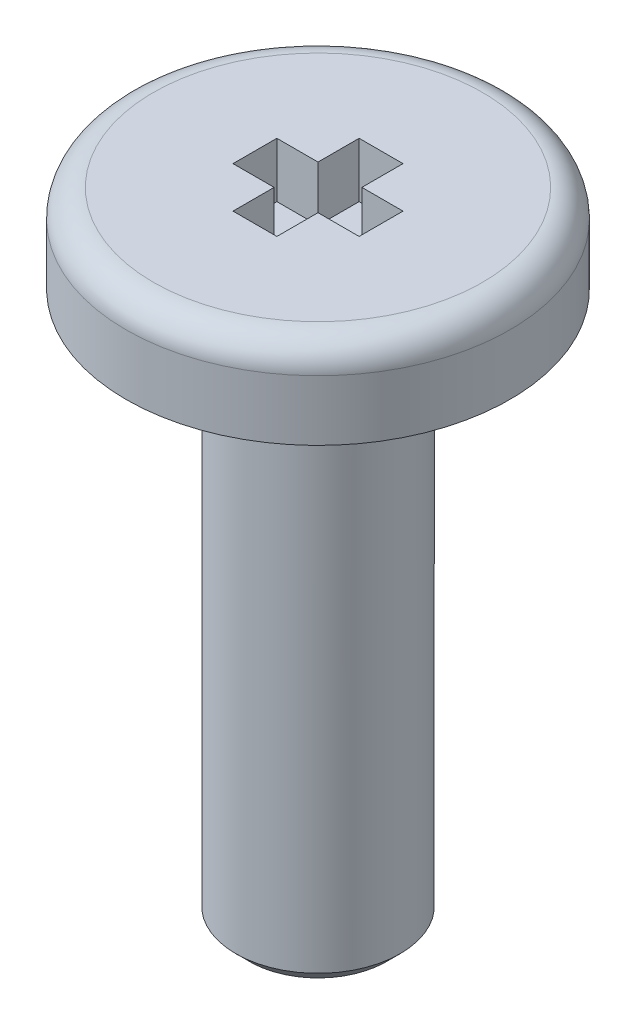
from build123d import *

# Parameters (mm, degrees)
SKETCH2_W               = 0.8
SKETCH2_H               = 2.3
CUT_EXTRUDE_THIN2_DEPTH = 1
CIRPATTERN1_COUNT       = 2
CIRPATTERN1_ANGLE       = 90
SKETCH3_R               = 1.5
BOSS_EXTRUDE1_DEPTH     = 10
FILLET1_R               = 0.2
CHAMFER1_SIZE           = 0.25


with BuildPart() as part:
    # Sketch1 → Base-Revolve (revolve)
    with BuildSketch(Plane.XY, mode=Mode.PRIVATE) as base_revolve_sk:
        with BuildLine():
            Line((3.5, 0), (0, 0))
            Line((0, 0), (0, 1.6))
            Line((0, 1.6), (3, 1.6))
            ThreePointArc((3, 1.6), (3.353553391, 1.453553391), (3.5, 1.1))
            Line((3.5, 1.1), (3.5, 0))
        make_face()
    revolve(base_revolve_sk.sketch.rotate(Axis((0, 11.592517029, 0), (0, -1, 0)), 90), axis=Axis((0, 11.592517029, 0), (0, -1, 0)))

    # Sketch2 → Cut-Extrude-Thin2 (cut)
    with BuildSketch(Plane(origin=(0, 1.6, 0), x_dir=(-1, 0, 0), z_dir=(0, 1, 0))):
        Rectangle(SKETCH2_W, SKETCH2_H)
    cut_extrude_thin2 = extrude(amount=-CUT_EXTRUDE_THIN2_DEPTH, mode=Mode.SUBTRACT)

    # CirPattern1: Cut-Extrude-Thin2 ×2 about axis
    cirpattern1_axis = Axis((0, 0, 0), (0, 1, 0))
    for i in range(1, CIRPATTERN1_COUNT):
        add(cut_extrude_thin2.rotate(cirpattern1_axis, i * CIRPATTERN1_ANGLE / (CIRPATTERN1_COUNT - 1)), mode=Mode.SUBTRACT)

    # Sketch3 → Boss-Extrude1 (add)
    with BuildSketch(Plane.XZ):
        with Locations(Location((0, 0, 0), (0, 0, 90))):
            Circle(SKETCH3_R)
    extrude(amount=BOSS_EXTRUDE1_DEPTH)

    # Fillet1
    fillet1_edges = [part.edges().sort_by_distance(p)[0] for p in [
        (0, 0, -1.5),
    ]]
    fillet(fillet1_edges, radius=FILLET1_R)

    # Chamfer1
    chamfer1_edges = [part.edges().sort_by_distance(p)[0] for p in [
        (0, -10, -1.5),
    ]]
    chamfer(chamfer1_edges, length=CHAMFER1_SIZE)


solid = part.part
